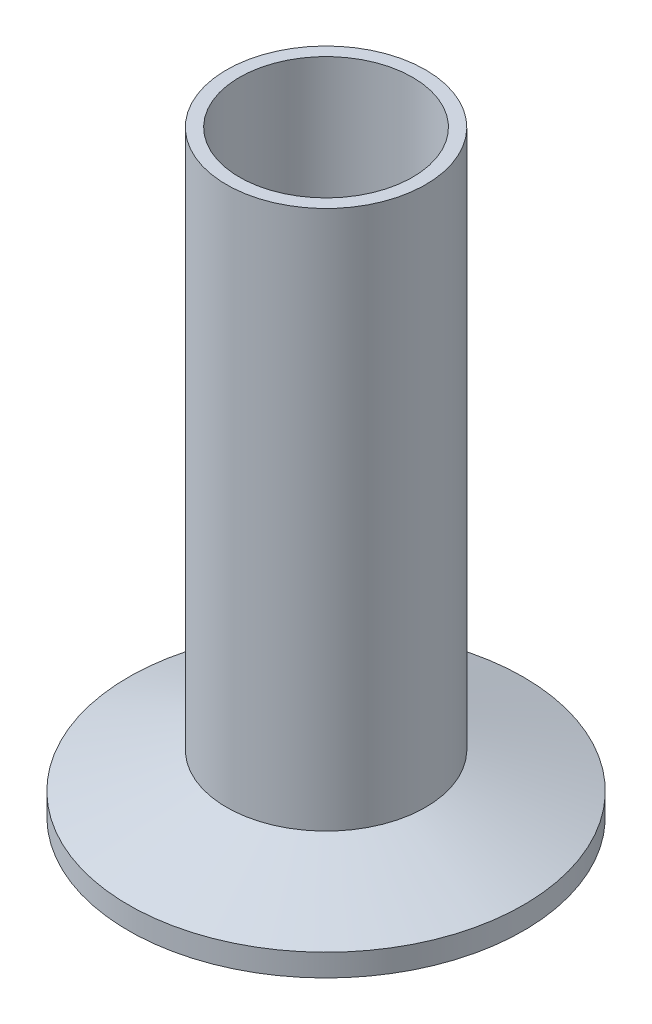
from build123d import *


with BuildPart() as part:
    # Sketch1 → Revolve2 (revolve)
    with BuildSketch(Plane.XY, mode=Mode.PRIVATE) as revolve2_sk:
        with BuildLine():
            Line((-11.049, 0), (-11.049, 76.2))
            Line((-11.049, 76.2), (-12.7, 76.2))
            Line((-12.7, 76.2), (-12.7, 7.393263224))
            Line((-12.7, 7.393263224), (-25.1968, 2.8448))
            Line((-25.1968, 2.8448), (-25.1968, 0))
            Line((-25.1968, 0), (-23.636608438, 0))
            ThreePointArc((-23.636608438, 0), (-23.204411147, 0.129217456), (-22.914066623, 0.474458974))
            ThreePointArc((-22.914066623, 0.474458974), (-21.8186, 1.1938), (-20.723133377, 0.474458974))
            ThreePointArc((-20.723133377, 0.474458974), (-20.432788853, 0.129217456), (-20.000591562, 0))
            Line((-20.000591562, 0), (-11.049, 0))
        make_face()
    revolve(revolve2_sk.sketch.rotate(Axis((0, 0, 0), (0, 1, 0)), 270), axis=Axis((0, 0, 0), (0, 1, 0)))


solid = part.part
